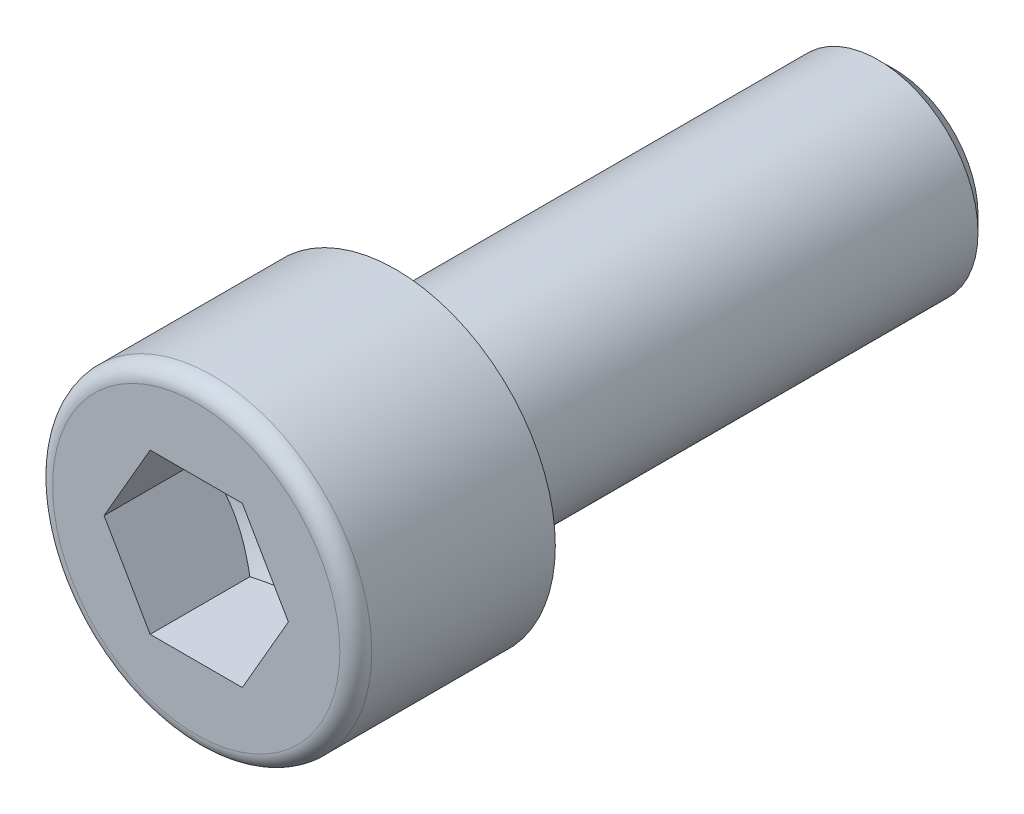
ISO-10303-21;
HEADER;
FILE_DESCRIPTION(('STEP AP214'),'2;1');
FILE_NAME('part.step','',(''),(''),'','','');
FILE_SCHEMA(('AUTOMOTIVE_DESIGN { 1 0 10303 214 1 1 1 1 }'));
ENDSEC;
DATA;
#1=APPLICATION_CONTEXT('core data for automotive mechanical design processes');
#2=APPLICATION_PROTOCOL_DEFINITION('international standard','automotive_design',2000,#1);
#3=PRODUCT_CONTEXT('',#1,'mechanical');
#4=PRODUCT('Part','Part','',(#3));
#5=PRODUCT_RELATED_PRODUCT_CATEGORY('part','',(#4));
#6=PRODUCT_DEFINITION_FORMATION('','',#4);
#7=PRODUCT_DEFINITION_CONTEXT('part definition',#1,'design');
#8=PRODUCT_DEFINITION('design','',#6,#7);
#9=PRODUCT_DEFINITION_SHAPE('','',#8);
#10=(LENGTH_UNIT() NAMED_UNIT(*) SI_UNIT(.MILLI.,.METRE.));
#11=(NAMED_UNIT(*) PLANE_ANGLE_UNIT() SI_UNIT($,.RADIAN.));
#12=(NAMED_UNIT(*) SI_UNIT($,.STERADIAN.) SOLID_ANGLE_UNIT());
#13=UNCERTAINTY_MEASURE_WITH_UNIT(LENGTH_MEASURE(1.E-05),#10,'distance_accuracy_value','');
#14=(GEOMETRIC_REPRESENTATION_CONTEXT(3) GLOBAL_UNCERTAINTY_ASSIGNED_CONTEXT((#13)) GLOBAL_UNIT_ASSIGNED_CONTEXT((#10,
#11,#12)) REPRESENTATION_CONTEXT('',''));
#15=CARTESIAN_POINT('',(0.,0.,0.));
#16=DIRECTION('',(0.,0.,1.));
#17=DIRECTION('',(1.,0.,0.));
#18=AXIS2_PLACEMENT_3D('',#15,#16,#17);
#19=CARTESIAN_POINT('',(0.,0.,10.));
#20=DIRECTION('',(0.,0.,1.));
#21=DIRECTION('',(1.,0.,0.));
#22=AXIS2_PLACEMENT_3D('',#19,#20,#21);
#23=PLANE('',#22);
#24=CARTESIAN_POINT('',(0.,0.,10.));
#25=DIRECTION('',(0.,0.,1.));
#26=DIRECTION('',(1.,0.,0.));
#27=AXIS2_PLACEMENT_3D('',#24,#25,#26);
#28=CIRCLE('',#27,7.2);
#29=CARTESIAN_POINT('',(7.2,0.,10.));
#30=VERTEX_POINT('',#29);
#31=EDGE_CURVE('E117',#30,#30,#28,.T.);
#32=ORIENTED_EDGE('',*,*,#31,.T.);
#33=EDGE_LOOP('',(#32));
#34=FACE_BOUND('',#33,.T.);
#35=DIRECTION('',(1.,0.,0.));
#36=VECTOR('',#35,1.);
#37=CARTESIAN_POINT('',(-2.3094,3.99999813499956,9.99999999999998));
#38=LINE('',#37,#36);
#39=CARTESIAN_POINT('',(-2.3094,3.99999813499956,9.99999999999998));
#40=VERTEX_POINT('',#39);
#41=CARTESIAN_POINT('',(2.30939999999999,3.99999813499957,10.));
#42=VERTEX_POINT('',#41);
#43=EDGE_CURVE('E94',#40,#42,#38,.T.);
#44=ORIENTED_EDGE('',*,*,#43,.T.);
#45=DIRECTION('',(0.5,-0.866025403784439,0.));
#46=VECTOR('',#45,1.);
#47=CARTESIAN_POINT('',(2.30939999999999,3.99999813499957,10.));
#48=LINE('',#47,#46);
#49=CARTESIAN_POINT('',(4.6188,0.,10.));
#50=VERTEX_POINT('',#49);
#51=EDGE_CURVE('E31',#42,#50,#48,.T.);
#52=ORIENTED_EDGE('',*,*,#51,.T.);
#53=DIRECTION('',(-0.5,-0.866025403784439,0.));
#54=VECTOR('',#53,1.);
#55=CARTESIAN_POINT('',(4.6188,0.,10.));
#56=LINE('',#55,#54);
#57=CARTESIAN_POINT('',(2.3094,-3.99999813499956,10.));
#58=VERTEX_POINT('',#57);
#59=EDGE_CURVE('E374',#50,#58,#56,.T.);
#60=ORIENTED_EDGE('',*,*,#59,.T.);
#61=DIRECTION('',(-1.,0.,0.));
#62=VECTOR('',#61,1.);
#63=CARTESIAN_POINT('',(2.3094,-3.99999813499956,10.));
#64=LINE('',#63,#62);
#65=CARTESIAN_POINT('',(-2.30940000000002,-3.99999813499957,9.99999999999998));
#66=VERTEX_POINT('',#65);
#67=EDGE_CURVE('E378',#58,#66,#64,.T.);
#68=ORIENTED_EDGE('',*,*,#67,.T.);
#69=DIRECTION('',(-0.5,0.866025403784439,0.));
#70=VECTOR('',#69,1.);
#71=CARTESIAN_POINT('',(-2.30940000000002,-3.99999813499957,9.99999999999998));
#72=LINE('',#71,#70);
#73=CARTESIAN_POINT('',(-4.6188,0.,10.));
#74=VERTEX_POINT('',#73);
#75=EDGE_CURVE('E382',#66,#74,#72,.T.);
#76=ORIENTED_EDGE('',*,*,#75,.T.);
#77=DIRECTION('',(0.5,0.866025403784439,0.));
#78=VECTOR('',#77,1.);
#79=CARTESIAN_POINT('',(-4.6188,0.,10.));
#80=LINE('',#79,#78);
#81=EDGE_CURVE('E103',#74,#40,#80,.T.);
#82=ORIENTED_EDGE('',*,*,#81,.T.);
#83=EDGE_LOOP('',(#44,#52,#60,#68,#76,#82));
#84=FACE_BOUND('',#83,.T.);
#85=ADVANCED_FACE('F15',(#34,#84),#23,.T.);
#86=CARTESIAN_POINT('',(0.,4.18812500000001,-25.));
#87=DIRECTION('',(0.,0.,-1.));
#88=DIRECTION('',(-1.,0.,0.));
#89=AXIS2_PLACEMENT_3D('',#86,#87,#88);
#90=PLANE('',#89);
#91=CARTESIAN_POINT('',(0.,0.,-25.));
#92=DIRECTION('',(0.,0.,1.));
#93=DIRECTION('',(1.,0.,0.));
#94=AXIS2_PLACEMENT_3D('',#91,#92,#93);
#95=CIRCLE('',#94,4.188125);
#96=CARTESIAN_POINT('',(4.188125,0.,-25.));
#97=VERTEX_POINT('',#96);
#98=EDGE_CURVE('E10',#97,#97,#95,.T.);
#99=ORIENTED_EDGE('',*,*,#98,.F.);
#100=EDGE_LOOP('',(#99));
#101=FACE_BOUND('',#100,.T.);
#102=ADVANCED_FACE('F17',(#101),#90,.T.);
#103=CARTESIAN_POINT('',(0.,0.,-24.188125));
#104=DIRECTION('',(0.,0.,1.));
#105=DIRECTION('',(1.,0.,0.));
#106=AXIS2_PLACEMENT_3D('',#103,#104,#105);
#107=CONICAL_SURFACE('',#106,5.,0.785398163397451);
#108=ORIENTED_EDGE('',*,*,#98,.T.);
#109=EDGE_LOOP('',(#108));
#110=FACE_BOUND('',#109,.T.);
#111=CARTESIAN_POINT('',(0.,0.,-24.188125));
#112=DIRECTION('',(0.,0.,1.));
#113=DIRECTION('',(1.,0.,0.));
#114=AXIS2_PLACEMENT_3D('',#111,#112,#113);
#115=CIRCLE('',#114,5.);
#116=CARTESIAN_POINT('',(5.,0.,-24.188125));
#117=VERTEX_POINT('',#116);
#118=EDGE_CURVE('E24',#117,#117,#115,.T.);
#119=ORIENTED_EDGE('',*,*,#118,.F.);
#120=EDGE_LOOP('',(#119));
#121=FACE_BOUND('',#120,.T.);
#122=ADVANCED_FACE('F158',(#110,#121),#107,.T.);
#123=CARTESIAN_POINT('',(0.,0.,10.));
#124=DIRECTION('',(0.,0.,1.));
#125=DIRECTION('',(1.,0.,0.));
#126=AXIS2_PLACEMENT_3D('',#123,#124,#125);
#127=CYLINDRICAL_SURFACE('',#126,5.);
#128=ORIENTED_EDGE('',*,*,#118,.T.);
#129=EDGE_LOOP('',(#128));
#130=FACE_BOUND('',#129,.T.);
#131=CARTESIAN_POINT('',(0.,0.,-1.90720874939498));
#132=DIRECTION('',(0.,0.,1.));
#133=DIRECTION('',(1.,0.,0.));
#134=AXIS2_PLACEMENT_3D('',#131,#132,#133);
#135=CIRCLE('',#134,5.);
#136=CARTESIAN_POINT('',(5.,0.,-1.90720874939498));
#137=VERTEX_POINT('',#136);
#138=EDGE_CURVE('E145',#137,#137,#135,.T.);
#139=ORIENTED_EDGE('',*,*,#138,.F.);
#140=EDGE_LOOP('',(#139));
#141=FACE_BOUND('',#140,.T.);
#142=ADVANCED_FACE('F155',(#130,#141),#127,.T.);
#143=CARTESIAN_POINT('',(0.,4.188125,-1.90720874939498));
#144=DIRECTION('',(0.,0.,1.));
#145=DIRECTION('',(1.,0.,0.));
#146=AXIS2_PLACEMENT_3D('',#143,#144,#145);
#147=PLANE('',#146);
#148=ORIENTED_EDGE('',*,*,#138,.T.);
#149=EDGE_LOOP('',(#148));
#150=FACE_BOUND('',#149,.T.);
#151=CARTESIAN_POINT('',(0.,0.,-1.90720874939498));
#152=DIRECTION('',(0.,0.,1.));
#153=DIRECTION('',(1.,0.,0.));
#154=AXIS2_PLACEMENT_3D('',#151,#152,#153);
#155=CIRCLE('',#154,4.188125);
#156=CARTESIAN_POINT('',(4.188125,0.,-1.90720874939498));
#157=VERTEX_POINT('',#156);
#158=EDGE_CURVE('E141',#157,#157,#155,.T.);
#159=ORIENTED_EDGE('',*,*,#158,.F.);
#160=EDGE_LOOP('',(#159));
#161=FACE_BOUND('',#160,.T.);
#162=ADVANCED_FACE('F166',(#150,#161),#147,.T.);
#163=CARTESIAN_POINT('',(0.,0.,-0.501000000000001));
#164=DIRECTION('',(0.,0.,1.));
#165=DIRECTION('',(1.,0.,0.));
#166=AXIS2_PLACEMENT_3D('',#163,#164,#165);
#167=CONICAL_SURFACE('',#166,5.,0.523598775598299);
#168=ORIENTED_EDGE('',*,*,#158,.T.);
#169=EDGE_LOOP('',(#168));
#170=FACE_BOUND('',#169,.T.);
#171=CARTESIAN_POINT('',(0.,0.,-0.501000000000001));
#172=DIRECTION('',(0.,0.,1.));
#173=DIRECTION('',(1.,0.,0.));
#174=AXIS2_PLACEMENT_3D('',#171,#172,#173);
#175=CIRCLE('',#174,5.);
#176=CARTESIAN_POINT('',(5.,0.,-0.501000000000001));
#177=VERTEX_POINT('',#176);
#178=EDGE_CURVE('E137',#177,#177,#175,.T.);
#179=ORIENTED_EDGE('',*,*,#178,.F.);
#180=EDGE_LOOP('',(#179));
#181=FACE_BOUND('',#180,.T.);
#182=ADVANCED_FACE('F198',(#170,#181),#167,.T.);
#183=CARTESIAN_POINT('',(0.,0.,10.));
#184=DIRECTION('',(0.,0.,1.));
#185=DIRECTION('',(1.,0.,0.));
#186=AXIS2_PLACEMENT_3D('',#183,#184,#185);
#187=CYLINDRICAL_SURFACE('',#186,5.);
#188=ORIENTED_EDGE('',*,*,#178,.T.);
#189=EDGE_LOOP('',(#188));
#190=FACE_BOUND('',#189,.T.);
#191=CARTESIAN_POINT('',(0.,0.,-0.5));
#192=DIRECTION('',(0.,0.,1.));
#193=DIRECTION('',(1.,0.,0.));
#194=AXIS2_PLACEMENT_3D('',#191,#192,#193);
#195=CIRCLE('',#194,5.);
#196=CARTESIAN_POINT('',(5.,0.,-0.5));
#197=VERTEX_POINT('',#196);
#198=EDGE_CURVE('E133',#197,#197,#195,.T.);
#199=ORIENTED_EDGE('',*,*,#198,.F.);
#200=EDGE_LOOP('',(#199));
#201=FACE_BOUND('',#200,.T.);
#202=ADVANCED_FACE('F194',(#190,#201),#187,.T.);
#203=CARTESIAN_POINT('',(0.,0.,-0.5));
#204=DIRECTION('',(0.,0.,1.));
#205=DIRECTION('',(1.,0.,0.));
#206=AXIS2_PLACEMENT_3D('',#203,#204,#205);
#207=TOROIDAL_SURFACE('',#206,5.5,0.5);
#208=ORIENTED_EDGE('',*,*,#198,.T.);
#209=EDGE_LOOP('',(#208));
#210=FACE_BOUND('',#209,.T.);
#211=CARTESIAN_POINT('',(0.,0.,0.));
#212=DIRECTION('',(0.,0.,1.));
#213=DIRECTION('',(1.,0.,0.));
#214=AXIS2_PLACEMENT_3D('',#211,#212,#213);
#215=CIRCLE('',#214,5.5);
#216=CARTESIAN_POINT('',(5.5,0.,0.));
#217=VERTEX_POINT('',#216);
#218=EDGE_CURVE('E129',#217,#217,#215,.T.);
#219=ORIENTED_EDGE('',*,*,#218,.F.);
#220=EDGE_LOOP('',(#219));
#221=FACE_BOUND('',#220,.T.);
#222=ADVANCED_FACE('F190',(#210,#221),#207,.F.);
#223=CARTESIAN_POINT('',(0.,8.00000000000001,0.));
#224=DIRECTION('',(0.,0.,-1.));
#225=DIRECTION('',(-1.,0.,0.));
#226=AXIS2_PLACEMENT_3D('',#223,#224,#225);
#227=PLANE('',#226);
#228=ORIENTED_EDGE('',*,*,#218,.T.);
#229=EDGE_LOOP('',(#228));
#230=FACE_BOUND('',#229,.T.);
#231=CARTESIAN_POINT('',(0.,0.,0.));
#232=DIRECTION('',(0.,0.,1.));
#233=DIRECTION('',(1.,0.,0.));
#234=AXIS2_PLACEMENT_3D('',#231,#232,#233);
#235=CIRCLE('',#234,8.);
#236=CARTESIAN_POINT('',(8.,0.,0.));
#237=VERTEX_POINT('',#236);
#238=EDGE_CURVE('E125',#237,#237,#235,.T.);
#239=ORIENTED_EDGE('',*,*,#238,.F.);
#240=EDGE_LOOP('',(#239));
#241=FACE_BOUND('',#240,.T.);
#242=ADVANCED_FACE('F186',(#230,#241),#227,.T.);
#243=CARTESIAN_POINT('',(0.,0.,10.));
#244=DIRECTION('',(0.,0.,1.));
#245=DIRECTION('',(1.,0.,0.));
#246=AXIS2_PLACEMENT_3D('',#243,#244,#245);
#247=CYLINDRICAL_SURFACE('',#246,8.);
#248=ORIENTED_EDGE('',*,*,#238,.T.);
#249=EDGE_LOOP('',(#248));
#250=FACE_BOUND('',#249,.T.);
#251=CARTESIAN_POINT('',(0.,0.,9.2));
#252=DIRECTION('',(0.,0.,1.));
#253=DIRECTION('',(1.,0.,0.));
#254=AXIS2_PLACEMENT_3D('',#251,#252,#253);
#255=CIRCLE('',#254,8.);
#256=CARTESIAN_POINT('',(8.,0.,9.2));
#257=VERTEX_POINT('',#256);
#258=EDGE_CURVE('E121',#257,#257,#255,.T.);
#259=ORIENTED_EDGE('',*,*,#258,.F.);
#260=EDGE_LOOP('',(#259));
#261=FACE_BOUND('',#260,.T.);
#262=ADVANCED_FACE('F182',(#250,#261),#247,.T.);
#263=CARTESIAN_POINT('',(0.,0.,9.2));
#264=DIRECTION('',(0.,0.,1.));
#265=DIRECTION('',(1.,0.,0.));
#266=AXIS2_PLACEMENT_3D('',#263,#264,#265);
#267=TOROIDAL_SURFACE('',#266,7.2,0.8);
#268=ORIENTED_EDGE('',*,*,#31,.F.);
#269=EDGE_LOOP('',(#268));
#270=FACE_BOUND('',#269,.T.);
#271=ORIENTED_EDGE('',*,*,#258,.T.);
#272=EDGE_LOOP('',(#271));
#273=FACE_BOUND('',#272,.T.);
#274=ADVANCED_FACE('F179',(#270,#273),#267,.T.);
#275=CARTESIAN_POINT('',(2.30939999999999,3.99999813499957,2.33333457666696));
#276=DIRECTION('',(-0.866025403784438,-0.5,0.));
#277=DIRECTION('',(-0.5,0.866025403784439,0.));
#278=AXIS2_PLACEMENT_3D('',#275,#276,#277);
#279=PLANE('',#278);
#280=DIRECTION('',(0.,0.,1.));
#281=VECTOR('',#280,1.);
#282=CARTESIAN_POINT('',(4.6188,0.,2.33333457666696));
#283=LINE('',#282,#281);
#284=CARTESIAN_POINT('',(4.61879999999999,0.,5.));
#285=VERTEX_POINT('',#284);
#286=EDGE_CURVE('E115',#285,#50,#283,.T.);
#287=ORIENTED_EDGE('',*,*,#286,.T.);
#288=ORIENTED_EDGE('',*,*,#51,.F.);
#289=DIRECTION('',(0.,0.,1.));
#290=VECTOR('',#289,1.);
#291=CARTESIAN_POINT('',(2.30939999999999,3.99999813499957,2.33333457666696));
#292=LINE('',#291,#290);
#293=CARTESIAN_POINT('',(2.3094,3.99999813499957,5.));
#294=VERTEX_POINT('',#293);
#295=EDGE_CURVE('E87',#294,#42,#292,.T.);
#296=ORIENTED_EDGE('',*,*,#295,.F.);
#297=CARTESIAN_POINT('',(4.61880115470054,-1.99999999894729E-06,5.0000006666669));
#298=CARTESIAN_POINT('',(4.51731699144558,0.175773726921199,4.9413917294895));
#299=CARTESIAN_POINT('',(4.41495681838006,0.353066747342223,4.88808996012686));
#300=CARTESIAN_POINT('',(4.20846417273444,0.71072250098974,4.79505330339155));
#301=CARTESIAN_POINT('',(4.10432803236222,0.891091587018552,4.75535132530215));
#302=CARTESIAN_POINT('',(3.8973462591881,1.24959453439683,4.69355230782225));
#303=CARTESIAN_POINT('',(3.7945324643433,1.42767325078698,4.67104391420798));
#304=CARTESIAN_POINT('',(3.58842135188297,1.78466816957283,4.64417856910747));
#305=CARTESIAN_POINT('',(3.48512478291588,1.96358307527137,4.63979936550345));
#306=CARTESIAN_POINT('',(3.29212607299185,2.29786664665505,4.64893266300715));
#307=CARTESIAN_POINT('',(3.20239497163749,2.45328547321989,4.66020263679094));
#308=CARTESIAN_POINT('',(3.02351733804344,2.76311062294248,4.69591468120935));
#309=CARTESIAN_POINT('',(2.93437142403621,2.91751587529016,4.7203689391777));
#310=CARTESIAN_POINT('',(2.75512528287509,3.22797929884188,4.78149987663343));
#311=CARTESIAN_POINT('',(2.66504773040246,3.38399819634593,4.81843556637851));
#312=CARTESIAN_POINT('',(2.48623574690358,3.69370963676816,4.90226397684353));
#313=CARTESIAN_POINT('',(2.39749902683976,3.84740614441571,4.9491370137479));
#314=CARTESIAN_POINT('',(2.30939884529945,4.00000013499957,5.00000066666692));
#315=B_SPLINE_CURVE_WITH_KNOTS('',3,(#297,#298,#299,#300,#301,#302,#303,#304,#305,#306,#307,
#308,#309,#310,#311,#312,#313,#314),.UNSPECIFIED.,.F.,.F.,(4,2,2,2,2,2,2,2,4),(0.,
0.63403188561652,1.26958736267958,1.88941479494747,2.50848121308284,3.04741577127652,
3.58684936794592,4.13824504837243,4.68855856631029),.UNSPECIFIED.);
#316=EDGE_CURVE('E79',#285,#294,#315,.T.);
#317=ORIENTED_EDGE('',*,*,#316,.F.);
#318=EDGE_LOOP('',(#287,#288,#296,#317));
#319=FACE_BOUND('',#318,.T.);
#320=ADVANCED_FACE('F88',(#319),#279,.T.);
#321=CARTESIAN_POINT('',(4.6188,0.,2.33333457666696));
#322=DIRECTION('',(-0.866025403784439,0.5,0.));
#323=DIRECTION('',(0.5,0.866025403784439,0.));
#324=AXIS2_PLACEMENT_3D('',#321,#322,#323);
#325=PLANE('',#324);
#326=DIRECTION('',(0.,0.,1.));
#327=VECTOR('',#326,1.);
#328=CARTESIAN_POINT('',(2.3094,-3.99999813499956,2.33333457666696));
#329=LINE('',#328,#327);
#330=CARTESIAN_POINT('',(2.3094,-3.99999813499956,4.99999999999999));
#331=VERTEX_POINT('',#330);
#332=EDGE_CURVE('E112',#331,#58,#329,.T.);
#333=ORIENTED_EDGE('',*,*,#332,.T.);
#334=ORIENTED_EDGE('',*,*,#59,.F.);
#335=ORIENTED_EDGE('',*,*,#286,.F.);
#336=CARTESIAN_POINT('',(2.30939884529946,-4.00000013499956,5.00000066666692));
#337=CARTESIAN_POINT('',(2.41088300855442,-3.82422440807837,4.94139172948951));
#338=CARTESIAN_POINT('',(2.51324318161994,-3.64693138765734,4.88808996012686));
#339=CARTESIAN_POINT('',(2.71973582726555,-3.28927563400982,4.79505330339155));
#340=CARTESIAN_POINT('',(2.82387196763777,-3.10890654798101,4.75535132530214));
#341=CARTESIAN_POINT('',(3.0308537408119,-2.75040360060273,4.69355230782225));
#342=CARTESIAN_POINT('',(3.13366753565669,-2.57232488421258,4.67104391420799));
#343=CARTESIAN_POINT('',(3.33977864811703,-2.21532996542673,4.64417856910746));
#344=CARTESIAN_POINT('',(3.44307521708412,-2.03641505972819,4.63979936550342));
#345=CARTESIAN_POINT('',(3.63607392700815,-1.70213148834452,4.64893266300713));
#346=CARTESIAN_POINT('',(3.7258050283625,-1.54671266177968,4.66020263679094));
#347=CARTESIAN_POINT('',(3.90468266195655,-1.23688751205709,4.69591468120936));
#348=CARTESIAN_POINT('',(3.99382857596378,-1.08248225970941,4.72036893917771));
#349=CARTESIAN_POINT('',(4.1730747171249,-0.772018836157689,4.78149987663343));
#350=CARTESIAN_POINT('',(4.26315226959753,-0.615999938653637,4.81843556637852));
#351=CARTESIAN_POINT('',(4.44196425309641,-0.30628849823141,4.90226397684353));
#352=CARTESIAN_POINT('',(4.53070097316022,-0.152591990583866,4.9491370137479));
#353=CARTESIAN_POINT('',(4.61880115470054,1.99999999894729E-06,5.00000066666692));
#354=B_SPLINE_CURVE_WITH_KNOTS('',3,(#336,#337,#338,#339,#340,#341,#342,#343,#344,#345,#346,
#347,#348,#349,#350,#351,#352,#353),.UNSPECIFIED.,.F.,.F.,(4,2,2,2,2,2,2,2,4),(0.,
0.634031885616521,1.26958736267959,1.88941479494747,2.50848121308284,3.04741577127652,
3.58684936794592,4.13824504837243,4.68855856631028),.UNSPECIFIED.);
#355=EDGE_CURVE('E83',#331,#285,#354,.T.);
#356=ORIENTED_EDGE('',*,*,#355,.F.);
#357=EDGE_LOOP('',(#333,#334,#335,#356));
#358=FACE_BOUND('',#357,.T.);
#359=ADVANCED_FACE('F263',(#358),#325,.T.);
#360=CARTESIAN_POINT('',(2.3094,-3.99999813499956,2.33333457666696));
#361=DIRECTION('',(0.,1.,0.));
#362=DIRECTION('',(1.,0.,0.));
#363=AXIS2_PLACEMENT_3D('',#360,#361,#362);
#364=PLANE('',#363);
#365=DIRECTION('',(0.,0.,1.));
#366=VECTOR('',#365,1.);
#367=CARTESIAN_POINT('',(-2.3094,-3.99999813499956,2.33333457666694));
#368=LINE('',#367,#366);
#369=CARTESIAN_POINT('',(-2.3094,-3.99999813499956,4.99999999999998));
#370=VERTEX_POINT('',#369);
#371=EDGE_CURVE('E109',#370,#66,#368,.T.);
#372=ORIENTED_EDGE('',*,*,#371,.T.);
#373=ORIENTED_EDGE('',*,*,#67,.F.);
#374=ORIENTED_EDGE('',*,*,#332,.F.);
#375=CARTESIAN_POINT('',(-5.98057769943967,-3.99999813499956,6.48734046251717));
#376=CARTESIAN_POINT('',(-5.80784400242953,-3.99999813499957,6.40446937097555));
#377=CARTESIAN_POINT('',(-5.63468950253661,-3.99999813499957,6.3224590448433));
#378=CARTESIAN_POINT('',(-5.28731462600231,-3.99999813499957,6.16064822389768));
#379=CARTESIAN_POINT('',(-5.11309406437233,-3.99999813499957,6.08084812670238));
#380=CARTESIAN_POINT('',(-4.76236385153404,-3.99999813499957,5.92350025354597));
#381=CARTESIAN_POINT('',(-4.58584672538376,-3.99999813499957,5.84596907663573));
#382=CARTESIAN_POINT('',(-4.23133125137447,-3.99999813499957,5.69438341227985));
#383=CARTESIAN_POINT('',(-4.05333298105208,-3.99999813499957,5.62032874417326));
#384=CARTESIAN_POINT('',(-3.69088328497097,-3.99999813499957,5.47473611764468));
#385=CARTESIAN_POINT('',(-3.50638481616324,-3.99999813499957,5.40331458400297));
#386=CARTESIAN_POINT('',(-3.1351562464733,-3.99999813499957,5.26640956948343));
#387=CARTESIAN_POINT('',(-2.94842588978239,-3.99999813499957,5.20092677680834));
#388=CARTESIAN_POINT('',(-2.57285948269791,-3.99999813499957,5.07776911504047));
#389=CARTESIAN_POINT('',(-2.38402930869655,-3.99999813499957,5.02007651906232));
#390=CARTESIAN_POINT('',(-2.00367935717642,-3.99999813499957,4.91448049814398));
#391=CARTESIAN_POINT('',(-1.81216050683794,-3.99999813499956,4.86657378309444));
#392=CARTESIAN_POINT('',(-1.42680740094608,-3.99999813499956,4.78309490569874));
#393=CARTESIAN_POINT('',(-1.23297862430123,-3.99999813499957,4.74749794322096));
#394=CARTESIAN_POINT('',(-0.843152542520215,-3.99999813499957,4.69097243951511));
#395=CARTESIAN_POINT('',(-0.647155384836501,-3.99999813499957,4.6700429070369));
#396=CARTESIAN_POINT('',(-0.256426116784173,-3.99999813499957,4.64479411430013));
#397=CARTESIAN_POINT('',(-0.0617069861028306,-3.99999813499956,4.64027884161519));
#398=CARTESIAN_POINT('',(0.327426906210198,-3.99999813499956,4.64773742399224));
#399=CARTESIAN_POINT('',(0.521841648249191,-3.99999813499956,4.6597123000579));
#400=CARTESIAN_POINT('',(0.858491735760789,-3.99999813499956,4.6939190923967));
#401=CARTESIAN_POINT('',(1.0010992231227,-3.99999813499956,4.71265719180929));
#402=CARTESIAN_POINT('',(1.28511976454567,-3.99999813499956,4.75771669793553));
#403=CARTESIAN_POINT('',(1.42653262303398,-3.99999813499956,4.78403932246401));
#404=CARTESIAN_POINT('',(1.84886975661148,-3.99999813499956,4.87298366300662));
#405=CARTESIAN_POINT('',(2.12771265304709,-3.99999813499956,4.9455613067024));
#406=CARTESIAN_POINT('',(2.54463286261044,-3.99999813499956,5.06954539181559));
#407=CARTESIAN_POINT('',(2.68490831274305,-3.99999813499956,5.11396517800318));
#408=CARTESIAN_POINT('',(2.96409503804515,-3.99999813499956,5.20694071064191));
#409=CARTESIAN_POINT('',(3.10300630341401,-3.99999813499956,5.25549648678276));
#410=CARTESIAN_POINT('',(3.3795201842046,-3.99999813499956,5.35600487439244));
#411=CARTESIAN_POINT('',(3.51712330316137,-3.99999813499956,5.40795611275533));
#412=CARTESIAN_POINT('',(3.79122042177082,-3.99999813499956,5.51469226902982));
#413=CARTESIAN_POINT('',(3.92771443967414,-3.99999813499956,5.56947714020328));
#414=CARTESIAN_POINT('',(4.27613178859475,-3.99999813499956,5.71283314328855));
#415=CARTESIAN_POINT('',(4.4873579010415,-3.99999813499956,5.80309663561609));
#416=CARTESIAN_POINT('',(4.90790712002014,-3.99999813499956,5.98796594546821));
#417=CARTESIAN_POINT('',(5.11723008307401,-3.99999813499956,6.08257208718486));
#418=CARTESIAN_POINT('',(5.53438003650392,-3.99999813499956,6.27514680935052));
#419=CARTESIAN_POINT('',(5.74220665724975,-3.99999813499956,6.37311618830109));
#420=CARTESIAN_POINT('',(6.15660822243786,-3.99999813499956,6.57167142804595));
#421=CARTESIAN_POINT('',(6.36318313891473,-3.99999813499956,6.67225734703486));
#422=CARTESIAN_POINT('',(6.98187222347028,-3.99999813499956,6.97733236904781));
#423=CARTESIAN_POINT('',(7.39246209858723,-3.99999813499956,7.18490978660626));
#424=CARTESIAN_POINT('',(8.21082357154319,-3.99999813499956,7.60536978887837));
#425=CARTESIAN_POINT('',(8.61859556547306,-3.99999813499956,7.81825160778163));
#426=CARTESIAN_POINT('',(9.39379825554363,-3.99999813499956,8.22743357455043));
#427=CARTESIAN_POINT('',(9.76140409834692,-3.99999813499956,8.42340243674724));
#428=CARTESIAN_POINT('',(10.4954354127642,-3.99999813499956,8.81757236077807));
#429=CARTESIAN_POINT('',(10.8618608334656,-3.99999813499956,9.01577351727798));
#430=CARTESIAN_POINT('',(11.5928697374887,-3.99999813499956,9.41334291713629));
#431=CARTESIAN_POINT('',(11.9574555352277,-3.99999813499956,9.61270690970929));
#432=CARTESIAN_POINT('',(12.6858880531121,-3.99999813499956,10.0127313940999));
#433=CARTESIAN_POINT('',(13.0497348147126,-3.99999813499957,10.2133918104));
#434=CARTESIAN_POINT('',(13.4133167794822,-3.99999813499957,10.4145278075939));
#435=B_SPLINE_CURVE_WITH_KNOTS('',3,(#375,#376,#377,#378,#379,#380,#381,#382,#383,#384,#385,
#386,#387,#388,#389,#390,#391,#392,#393,#394,#395,#396,#397,#398,#399,#400,#401,#402,#403,#404,
#405,#406,#407,#408,#409,#410,#411,#412,#413,#414,#415,#416,#417,#418,#419,#420,#421,#422,#423,
#424,#425,#426,#427,#428,#429,#430,#431,#432,#433,#434),.UNSPECIFIED.,.F.,.F.,(4,2,2,2,2,2,2,2,
2,2,2,2,2,2,2,2,2,2,2,2,2,2,2,2,2,2,2,2,2,4),(0.,0.574761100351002,1.1496249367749,
1.72797591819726,2.30629681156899,2.89973831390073,3.49324849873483,4.08538451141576,
4.67732111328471,5.2680581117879,5.85875518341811,6.44237478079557,7.02603051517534,
7.45731714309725,7.88867305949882,8.7519258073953,9.19331611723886,9.63470959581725,
10.0759256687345,10.5171344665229,11.2061762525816,11.8952695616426,12.5845276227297,
13.2738010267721,14.6539663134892,16.0339334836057,17.2836592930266,18.5334383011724,
19.7800384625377,21.0265666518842),.UNSPECIFIED.);
#436=EDGE_CURVE('E329',#370,#331,#435,.T.);
#437=ORIENTED_EDGE('',*,*,#436,.F.);
#438=EDGE_LOOP('',(#372,#373,#374,#437));
#439=FACE_BOUND('',#438,.T.);
#440=ADVANCED_FACE('F270',(#439),#364,.T.);
#441=CARTESIAN_POINT('',(-2.3094,-3.99999813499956,2.33333457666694));
#442=DIRECTION('',(0.866025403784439,0.5,0.));
#443=DIRECTION('',(0.5,-0.866025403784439,0.));
#444=AXIS2_PLACEMENT_3D('',#441,#442,#443);
#445=PLANE('',#444);
#446=DIRECTION('',(0.,0.,1.));
#447=VECTOR('',#446,1.);
#448=CARTESIAN_POINT('',(-4.61880000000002,0.,2.33333457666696));
#449=LINE('',#448,#447);
#450=CARTESIAN_POINT('',(-4.6188,0.,5.));
#451=VERTEX_POINT('',#450);
#452=EDGE_CURVE('E100',#451,#74,#449,.T.);
#453=ORIENTED_EDGE('',*,*,#452,.T.);
#454=ORIENTED_EDGE('',*,*,#75,.F.);
#455=ORIENTED_EDGE('',*,*,#371,.F.);
#456=CARTESIAN_POINT('',(-4.61880115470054,1.99999999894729E-06,5.00000066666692));
#457=CARTESIAN_POINT('',(-4.51731699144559,-0.175773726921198,4.9413917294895));
#458=CARTESIAN_POINT('',(-4.41495681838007,-0.353066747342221,4.88808996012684));
#459=CARTESIAN_POINT('',(-4.20846417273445,-0.710722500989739,4.79505330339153));
#460=CARTESIAN_POINT('',(-4.10432803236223,-0.891091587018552,4.75535132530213));
#461=CARTESIAN_POINT('',(-3.89734625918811,-1.24959453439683,4.69355230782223));
#462=CARTESIAN_POINT('',(-3.79453246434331,-1.42767325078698,4.67104391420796));
#463=CARTESIAN_POINT('',(-3.58842135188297,-1.78466816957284,4.64417856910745));
#464=CARTESIAN_POINT('',(-3.48512478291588,-1.96358307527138,4.63979936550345));
#465=CARTESIAN_POINT('',(-3.29212607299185,-2.29786664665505,4.64893266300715));
#466=CARTESIAN_POINT('',(-3.2023949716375,-2.4532854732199,4.66020263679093));
#467=CARTESIAN_POINT('',(-3.02351733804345,-2.76311062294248,4.69591468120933));
#468=CARTESIAN_POINT('',(-2.93437142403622,-2.91751587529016,4.72036893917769));
#469=CARTESIAN_POINT('',(-2.7551252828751,-3.22797929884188,4.78149987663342));
#470=CARTESIAN_POINT('',(-2.66504773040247,-3.38399819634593,4.8184355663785));
#471=CARTESIAN_POINT('',(-2.48623574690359,-3.69370963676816,4.90226397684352));
#472=CARTESIAN_POINT('',(-2.39749902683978,-3.8474061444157,4.94913701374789));
#473=CARTESIAN_POINT('',(-2.30939884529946,-4.00000013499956,5.00000066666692));
#474=B_SPLINE_CURVE_WITH_KNOTS('',3,(#456,#457,#458,#459,#460,#461,#462,#463,#464,#465,#466,
#467,#468,#469,#470,#471,#472,#473),.UNSPECIFIED.,.F.,.F.,(4,2,2,2,2,2,2,2,4),(0.,
0.634031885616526,1.26958736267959,1.88941479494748,2.50848121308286,3.04741577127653,
3.58684936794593,4.13824504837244,4.68855856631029),.UNSPECIFIED.);
#475=EDGE_CURVE('E322',#451,#370,#474,.T.);
#476=ORIENTED_EDGE('',*,*,#475,.F.);
#477=EDGE_LOOP('',(#453,#454,#455,#476));
#478=FACE_BOUND('',#477,.T.);
#479=ADVANCED_FACE('F278',(#478),#445,.T.);
#480=CARTESIAN_POINT('',(-4.61880000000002,0.,2.33333457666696));
#481=DIRECTION('',(0.866025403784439,-0.5,0.));
#482=DIRECTION('',(-0.5,-0.866025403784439,0.));
#483=AXIS2_PLACEMENT_3D('',#480,#481,#482);
#484=PLANE('',#483);
#485=DIRECTION('',(0.,0.,1.));
#486=VECTOR('',#485,1.);
#487=CARTESIAN_POINT('',(-2.3094,3.99999813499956,2.33333457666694));
#488=LINE('',#487,#486);
#489=CARTESIAN_POINT('',(-2.30940000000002,3.99999813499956,5.));
#490=VERTEX_POINT('',#489);
#491=EDGE_CURVE('E93',#490,#40,#488,.T.);
#492=ORIENTED_EDGE('',*,*,#491,.T.);
#493=ORIENTED_EDGE('',*,*,#81,.F.);
#494=ORIENTED_EDGE('',*,*,#452,.F.);
#495=CARTESIAN_POINT('',(-2.30939884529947,4.00000013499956,5.00000066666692));
#496=CARTESIAN_POINT('',(-2.41088300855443,3.82422440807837,4.94139172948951));
#497=CARTESIAN_POINT('',(-2.51324318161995,3.64693138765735,4.88808996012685));
#498=CARTESIAN_POINT('',(-2.71973582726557,3.28927563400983,4.79505330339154));
#499=CARTESIAN_POINT('',(-2.82387196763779,3.10890654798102,4.75535132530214));
#500=CARTESIAN_POINT('',(-3.03085374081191,2.75040360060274,4.69355230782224));
#501=CARTESIAN_POINT('',(-3.13366753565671,2.57232488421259,4.67104391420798));
#502=CARTESIAN_POINT('',(-3.33977864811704,2.21532996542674,4.64417856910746));
#503=CARTESIAN_POINT('',(-3.44307521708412,2.03641505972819,4.63979936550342));
#504=CARTESIAN_POINT('',(-3.63607392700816,1.70213148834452,4.64893266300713));
#505=CARTESIAN_POINT('',(-3.72580502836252,1.54671266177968,4.66020263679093));
#506=CARTESIAN_POINT('',(-3.90468266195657,1.2368875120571,4.69591468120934));
#507=CARTESIAN_POINT('',(-3.9938285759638,1.08248225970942,4.72036893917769));
#508=CARTESIAN_POINT('',(-4.17307471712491,0.772018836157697,4.78149987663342));
#509=CARTESIAN_POINT('',(-4.26315226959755,0.615999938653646,4.8184355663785));
#510=CARTESIAN_POINT('',(-4.44196425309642,0.306288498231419,4.90226397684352));
#511=CARTESIAN_POINT('',(-4.53070097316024,0.152591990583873,4.94913701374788));
#512=CARTESIAN_POINT('',(-4.61880115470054,-1.99999999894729E-06,5.0000006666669));
#513=B_SPLINE_CURVE_WITH_KNOTS('',3,(#495,#496,#497,#498,#499,#500,#501,#502,#503,#504,#505,
#506,#507,#508,#509,#510,#511,#512),.UNSPECIFIED.,.F.,.F.,(4,2,2,2,2,2,2,2,4),(0.,
0.634031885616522,1.26958736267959,1.88941479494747,2.50848121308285,3.04741577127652,
3.58684936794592,4.13824504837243,4.68855856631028),.UNSPECIFIED.);
#514=EDGE_CURVE('E39',#490,#451,#513,.T.);
#515=ORIENTED_EDGE('',*,*,#514,.F.);
#516=EDGE_LOOP('',(#492,#493,#494,#515));
#517=FACE_BOUND('',#516,.T.);
#518=ADVANCED_FACE('F287',(#517),#484,.T.);
#519=CARTESIAN_POINT('',(-2.3094,3.99999813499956,2.33333457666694));
#520=DIRECTION('',(0.,-1.,0.));
#521=DIRECTION('',(-1.,0.,0.));
#522=AXIS2_PLACEMENT_3D('',#519,#520,#521);
#523=PLANE('',#522);
#524=ORIENTED_EDGE('',*,*,#295,.T.);
#525=ORIENTED_EDGE('',*,*,#43,.F.);
#526=ORIENTED_EDGE('',*,*,#491,.F.);
#527=CARTESIAN_POINT('',(-5.98057769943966,3.99999813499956,6.48734046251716));
#528=CARTESIAN_POINT('',(-5.80784400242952,3.99999813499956,6.40446937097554));
#529=CARTESIAN_POINT('',(-5.6346895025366,3.99999813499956,6.3224590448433));
#530=CARTESIAN_POINT('',(-5.28731462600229,3.99999813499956,6.16064822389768));
#531=CARTESIAN_POINT('',(-5.11309406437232,3.99999813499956,6.08084812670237));
#532=CARTESIAN_POINT('',(-4.76236385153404,3.99999813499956,5.92350025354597));
#533=CARTESIAN_POINT('',(-4.58584672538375,3.99999813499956,5.84596907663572));
#534=CARTESIAN_POINT('',(-4.23133125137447,3.99999813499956,5.69438341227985));
#535=CARTESIAN_POINT('',(-4.05333298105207,3.99999813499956,5.62032874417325));
#536=CARTESIAN_POINT('',(-3.69088328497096,3.99999813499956,5.47473611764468));
#537=CARTESIAN_POINT('',(-3.50638481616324,3.99999813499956,5.40331458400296));
#538=CARTESIAN_POINT('',(-3.13515624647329,3.99999813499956,5.26640956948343));
#539=CARTESIAN_POINT('',(-2.94842588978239,3.99999813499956,5.20092677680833));
#540=CARTESIAN_POINT('',(-2.57285948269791,3.99999813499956,5.07776911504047));
#541=CARTESIAN_POINT('',(-2.38402930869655,3.99999813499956,5.02007651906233));
#542=CARTESIAN_POINT('',(-2.00367935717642,3.99999813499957,4.91448049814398));
#543=CARTESIAN_POINT('',(-1.81216050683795,3.99999813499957,4.86657378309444));
#544=CARTESIAN_POINT('',(-1.42680740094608,3.99999813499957,4.78309490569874));
#545=CARTESIAN_POINT('',(-1.23297862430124,3.99999813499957,4.74749794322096));
#546=CARTESIAN_POINT('',(-0.843152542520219,3.99999813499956,4.69097243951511));
#547=CARTESIAN_POINT('',(-0.647155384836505,3.99999813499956,4.6700429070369));
#548=CARTESIAN_POINT('',(-0.256426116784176,3.99999813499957,4.64479411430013));
#549=CARTESIAN_POINT('',(-0.0617069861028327,3.99999813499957,4.6402788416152));
#550=CARTESIAN_POINT('',(0.327426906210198,3.99999813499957,4.64773742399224));
#551=CARTESIAN_POINT('',(0.52184164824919,3.99999813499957,4.6597123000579));
#552=CARTESIAN_POINT('',(0.858491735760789,3.99999813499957,4.6939190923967));
#553=CARTESIAN_POINT('',(1.0010992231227,3.99999813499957,4.71265719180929));
#554=CARTESIAN_POINT('',(1.28511976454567,3.99999813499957,4.75771669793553));
#555=CARTESIAN_POINT('',(1.42653262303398,3.99999813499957,4.78403932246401));
#556=CARTESIAN_POINT('',(1.84886975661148,3.99999813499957,4.87298366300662));
#557=CARTESIAN_POINT('',(2.12771265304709,3.99999813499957,4.9455613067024));
#558=CARTESIAN_POINT('',(2.54463286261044,3.99999813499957,5.06954539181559));
#559=CARTESIAN_POINT('',(2.68490831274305,3.99999813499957,5.11396517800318));
#560=CARTESIAN_POINT('',(2.96409503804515,3.99999813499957,5.20694071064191));
#561=CARTESIAN_POINT('',(3.10300630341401,3.99999813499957,5.25549648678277));
#562=CARTESIAN_POINT('',(3.3795201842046,3.99999813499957,5.35600487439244));
#563=CARTESIAN_POINT('',(3.51712330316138,3.99999813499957,5.40795611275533));
#564=CARTESIAN_POINT('',(3.79122042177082,3.99999813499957,5.51469226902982));
#565=CARTESIAN_POINT('',(3.92771443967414,3.99999813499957,5.56947714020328));
#566=CARTESIAN_POINT('',(4.27613178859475,3.99999813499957,5.71283314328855));
#567=CARTESIAN_POINT('',(4.4873579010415,3.99999813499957,5.80309663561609));
#568=CARTESIAN_POINT('',(4.90790712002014,3.99999813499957,5.98796594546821));
#569=CARTESIAN_POINT('',(5.117230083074,3.99999813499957,6.08257208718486));
#570=CARTESIAN_POINT('',(5.53438003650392,3.99999813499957,6.27514680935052));
#571=CARTESIAN_POINT('',(5.74220665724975,3.99999813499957,6.37311618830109));
#572=CARTESIAN_POINT('',(6.15660822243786,3.99999813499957,6.57167142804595));
#573=CARTESIAN_POINT('',(6.36318313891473,3.99999813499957,6.67225734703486));
#574=CARTESIAN_POINT('',(6.98187222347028,3.99999813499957,6.97733236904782));
#575=CARTESIAN_POINT('',(7.39246209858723,3.99999813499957,7.18490978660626));
#576=CARTESIAN_POINT('',(8.21082357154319,3.99999813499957,7.60536978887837));
#577=CARTESIAN_POINT('',(8.61859556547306,3.99999813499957,7.81825160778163));
#578=CARTESIAN_POINT('',(9.39379825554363,3.99999813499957,8.22743357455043));
#579=CARTESIAN_POINT('',(9.76140409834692,3.99999813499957,8.42340243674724));
#580=CARTESIAN_POINT('',(10.4954354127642,3.99999813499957,8.81757236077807));
#581=CARTESIAN_POINT('',(10.8618608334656,3.99999813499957,9.01577351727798));
#582=CARTESIAN_POINT('',(11.5928697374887,3.99999813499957,9.4133429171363));
#583=CARTESIAN_POINT('',(11.9574555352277,3.99999813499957,9.6127069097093));
#584=CARTESIAN_POINT('',(12.6858880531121,3.99999813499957,10.0127313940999));
#585=CARTESIAN_POINT('',(13.0497348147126,3.99999813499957,10.2133918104));
#586=CARTESIAN_POINT('',(13.4133167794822,3.99999813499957,10.4145278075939));
#587=B_SPLINE_CURVE_WITH_KNOTS('',3,(#527,#528,#529,#530,#531,#532,#533,#534,#535,#536,#537,
#538,#539,#540,#541,#542,#543,#544,#545,#546,#547,#548,#549,#550,#551,#552,#553,#554,#555,#556,
#557,#558,#559,#560,#561,#562,#563,#564,#565,#566,#567,#568,#569,#570,#571,#572,#573,#574,#575,
#576,#577,#578,#579,#580,#581,#582,#583,#584,#585,#586),.UNSPECIFIED.,.F.,.F.,(4,2,2,2,2,2,2,2,
2,2,2,2,2,2,2,2,2,2,2,2,2,2,2,2,2,2,2,2,2,4),(0.,0.574761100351,1.14962493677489,
1.72797591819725,2.30629681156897,2.89973831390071,3.49324849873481,4.08538451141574,
4.67732111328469,5.26805811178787,5.85875518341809,6.44237478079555,7.02603051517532,
7.45731714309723,7.8886730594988,8.75192580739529,9.19331611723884,9.63470959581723,
10.0759256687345,10.5171344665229,11.2061762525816,11.8952695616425,12.5845276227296,
13.273801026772,14.6539663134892,16.0339334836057,17.2836592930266,18.5334383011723,
19.7800384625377,21.0265666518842),.UNSPECIFIED.);
#588=EDGE_CURVE('E80',#294,#490,#587,.F.);
#589=ORIENTED_EDGE('',*,*,#588,.F.);
#590=EDGE_LOOP('',(#524,#525,#526,#589));
#591=FACE_BOUND('',#590,.T.);
#592=ADVANCED_FACE('F75',(#591),#523,.T.);
#593=CARTESIAN_POINT('',(0.,0.,2.33333457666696));
#594=DIRECTION('',(0.,0.,1.));
#595=DIRECTION('',(1.,0.,0.));
#596=AXIS2_PLACEMENT_3D('',#593,#594,#595);
#597=CONICAL_SURFACE('',#596,0.,1.0471975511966);
#598=CARTESIAN_POINT('',(0.,0.,2.33333457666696));
#599=VERTEX_POINT('',#598);
#600=VERTEX_LOOP('',#599);
#601=FACE_BOUND('',#600,.T.);
#602=ORIENTED_EDGE('',*,*,#316,.T.);
#603=ORIENTED_EDGE('',*,*,#588,.T.);
#604=ORIENTED_EDGE('',*,*,#514,.T.);
#605=ORIENTED_EDGE('',*,*,#475,.T.);
#606=ORIENTED_EDGE('',*,*,#436,.T.);
#607=ORIENTED_EDGE('',*,*,#355,.T.);
#608=EDGE_LOOP('',(#602,#603,#604,#605,#606,#607));
#609=FACE_BOUND('',#608,.T.);
#610=ADVANCED_FACE('F72',(#601,#609),#597,.F.);
#611=CLOSED_SHELL('',(#85,#102,#122,#142,#162,#182,#202,#222,#242,#262,#274,#320,#359,#440,#479,
#518,#592,#610));
#612=MANIFOLD_SOLID_BREP('B1',#611);
#613=ADVANCED_BREP_SHAPE_REPRESENTATION('',(#18,#612),#14);
#614=SHAPE_DEFINITION_REPRESENTATION(#9,#613);
ENDSEC;
END-ISO-10303-21;
